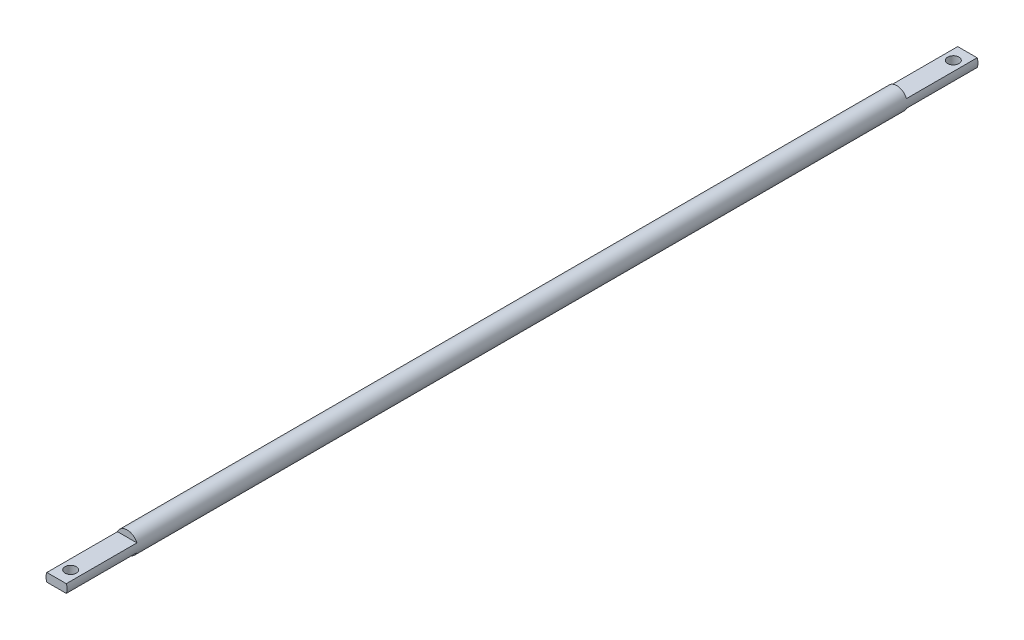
ISO-10303-21;
HEADER;
FILE_DESCRIPTION(('STEP AP214'),'2;1');
FILE_NAME('part.step','',(''),(''),'','','');
FILE_SCHEMA(('AUTOMOTIVE_DESIGN { 1 0 10303 214 1 1 1 1 }'));
ENDSEC;
DATA;
#1=APPLICATION_CONTEXT('core data for automotive mechanical design processes');
#2=APPLICATION_PROTOCOL_DEFINITION('international standard','automotive_design',2000,#1);
#3=PRODUCT_CONTEXT('',#1,'mechanical');
#4=PRODUCT('Part','Part','',(#3));
#5=PRODUCT_RELATED_PRODUCT_CATEGORY('part','',(#4));
#6=PRODUCT_DEFINITION_FORMATION('','',#4);
#7=PRODUCT_DEFINITION_CONTEXT('part definition',#1,'design');
#8=PRODUCT_DEFINITION('design','',#6,#7);
#9=PRODUCT_DEFINITION_SHAPE('','',#8);
#10=(LENGTH_UNIT() NAMED_UNIT(*) SI_UNIT(.MILLI.,.METRE.));
#11=(NAMED_UNIT(*) PLANE_ANGLE_UNIT() SI_UNIT($,.RADIAN.));
#12=(NAMED_UNIT(*) SI_UNIT($,.STERADIAN.) SOLID_ANGLE_UNIT());
#13=UNCERTAINTY_MEASURE_WITH_UNIT(LENGTH_MEASURE(1.E-05),#10,'distance_accuracy_value','');
#14=(GEOMETRIC_REPRESENTATION_CONTEXT(3) GLOBAL_UNCERTAINTY_ASSIGNED_CONTEXT((#13)) GLOBAL_UNIT_ASSIGNED_CONTEXT((#10,
#11,#12)) REPRESENTATION_CONTEXT('',''));
#15=CARTESIAN_POINT('',(0.,0.,0.));
#16=DIRECTION('',(0.,0.,1.));
#17=DIRECTION('',(1.,0.,0.));
#18=AXIS2_PLACEMENT_3D('',#15,#16,#17);
#19=CARTESIAN_POINT('',(8.29864188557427,3.,-272.5));
#20=DIRECTION('',(0.,-1.,0.));
#21=DIRECTION('',(0.,0.,-1.));
#22=AXIS2_PLACEMENT_3D('',#19,#20,#21);
#23=PLANE('',#22);
#24=DIRECTION('',(-1.,0.,0.));
#25=VECTOR('',#24,1.);
#26=CARTESIAN_POINT('',(8.29864188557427,3.,-272.5));
#27=LINE('',#26,#25);
#28=CARTESIAN_POINT('',(6.87386354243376,3.,-272.5));
#29=VERTEX_POINT('',#28);
#30=CARTESIAN_POINT('',(-6.87386354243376,3.,-272.5));
#31=VERTEX_POINT('',#30);
#32=EDGE_CURVE('E109',#29,#31,#27,.T.);
#33=ORIENTED_EDGE('',*,*,#32,.F.);
#34=DIRECTION('',(0.,0.,-1.));
#35=VECTOR('',#34,1.);
#36=CARTESIAN_POINT('',(6.87386354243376,3.,322.5));
#37=LINE('',#36,#35);
#38=CARTESIAN_POINT('',(6.87386354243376,3.,-322.5));
#39=VERTEX_POINT('',#38);
#40=EDGE_CURVE('E142',#39,#29,#37,.F.);
#41=ORIENTED_EDGE('',*,*,#40,.F.);
#42=DIRECTION('',(1.,0.,0.));
#43=VECTOR('',#42,1.);
#44=CARTESIAN_POINT('',(0.,3.,-322.5));
#45=LINE('',#44,#43);
#46=CARTESIAN_POINT('',(-6.87386354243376,3.,-322.5));
#47=VERTEX_POINT('',#46);
#48=EDGE_CURVE('E113',#47,#39,#45,.T.);
#49=ORIENTED_EDGE('',*,*,#48,.F.);
#50=DIRECTION('',(0.,0.,-1.));
#51=VECTOR('',#50,1.);
#52=CARTESIAN_POINT('',(-6.87386354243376,3.,322.5));
#53=LINE('',#52,#51);
#54=EDGE_CURVE('E143',#31,#47,#53,.T.);
#55=ORIENTED_EDGE('',*,*,#54,.F.);
#56=EDGE_LOOP('',(#33,#41,#49,#55));
#57=FACE_BOUND('',#56,.T.);
#58=CARTESIAN_POINT('',(0.,3.,-312.5));
#59=DIRECTION('',(0.,-1.,0.));
#60=DIRECTION('',(0.,0.,-1.));
#61=AXIS2_PLACEMENT_3D('',#58,#59,#60);
#62=CIRCLE('',#61,4.);
#63=CARTESIAN_POINT('',(0.,3.,-316.5));
#64=VERTEX_POINT('',#63);
#65=EDGE_CURVE('E304',#64,#64,#62,.F.);
#66=ORIENTED_EDGE('',*,*,#65,.F.);
#67=EDGE_LOOP('',(#66));
#68=FACE_BOUND('',#67,.T.);
#69=ADVANCED_FACE('F36',(#57,#68),#23,.F.);
#70=CARTESIAN_POINT('',(8.29864188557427,-3.,-272.5));
#71=DIRECTION('',(0.,1.,0.));
#72=DIRECTION('',(0.,0.,1.));
#73=AXIS2_PLACEMENT_3D('',#70,#71,#72);
#74=PLANE('',#73);
#75=DIRECTION('',(1.,0.,0.));
#76=VECTOR('',#75,1.);
#77=CARTESIAN_POINT('',(8.29864188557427,-3.,-272.5));
#78=LINE('',#77,#76);
#79=CARTESIAN_POINT('',(-6.87386354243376,-3.,-272.5));
#80=VERTEX_POINT('',#79);
#81=CARTESIAN_POINT('',(6.87386354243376,-3.,-272.5));
#82=VERTEX_POINT('',#81);
#83=EDGE_CURVE('E296',#80,#82,#78,.T.);
#84=ORIENTED_EDGE('',*,*,#83,.F.);
#85=DIRECTION('',(0.,0.,-1.));
#86=VECTOR('',#85,1.);
#87=CARTESIAN_POINT('',(-6.87386354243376,-3.,322.5));
#88=LINE('',#87,#86);
#89=CARTESIAN_POINT('',(-6.87386354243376,-3.,-322.5));
#90=VERTEX_POINT('',#89);
#91=EDGE_CURVE('E51',#90,#80,#88,.F.);
#92=ORIENTED_EDGE('',*,*,#91,.F.);
#93=DIRECTION('',(-1.,0.,0.));
#94=VECTOR('',#93,1.);
#95=CARTESIAN_POINT('',(0.,-3.,-322.5));
#96=LINE('',#95,#94);
#97=CARTESIAN_POINT('',(6.87386354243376,-3.,-322.5));
#98=VERTEX_POINT('',#97);
#99=EDGE_CURVE('E44',#98,#90,#96,.T.);
#100=ORIENTED_EDGE('',*,*,#99,.F.);
#101=DIRECTION('',(0.,0.,-1.));
#102=VECTOR('',#101,1.);
#103=CARTESIAN_POINT('',(6.87386354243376,-3.,322.5));
#104=LINE('',#103,#102);
#105=EDGE_CURVE('E102',#82,#98,#104,.T.);
#106=ORIENTED_EDGE('',*,*,#105,.F.);
#107=EDGE_LOOP('',(#84,#92,#100,#106));
#108=FACE_BOUND('',#107,.T.);
#109=CARTESIAN_POINT('',(0.,-3.,-312.5));
#110=DIRECTION('',(0.,1.,0.));
#111=DIRECTION('',(0.,0.,1.));
#112=AXIS2_PLACEMENT_3D('',#109,#110,#111);
#113=CIRCLE('',#112,4.);
#114=CARTESIAN_POINT('',(0.,-3.,-308.5));
#115=VERTEX_POINT('',#114);
#116=EDGE_CURVE('E307',#115,#115,#113,.T.);
#117=ORIENTED_EDGE('',*,*,#116,.T.);
#118=EDGE_LOOP('',(#117));
#119=FACE_BOUND('',#118,.T.);
#120=ADVANCED_FACE('F100',(#108,#119),#74,.F.);
#121=CARTESIAN_POINT('',(0.,0.,322.5));
#122=DIRECTION('',(0.,0.,-1.));
#123=DIRECTION('',(-1.,0.,0.));
#124=AXIS2_PLACEMENT_3D('',#121,#122,#123);
#125=CYLINDRICAL_SURFACE('',#124,7.5);
#126=CARTESIAN_POINT('',(0.,0.,322.5));
#127=DIRECTION('',(0.,0.,1.));
#128=DIRECTION('',(1.,0.,0.));
#129=AXIS2_PLACEMENT_3D('',#126,#127,#128);
#130=CIRCLE('',#129,7.5);
#131=CARTESIAN_POINT('',(6.87386354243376,-3.,322.5));
#132=VERTEX_POINT('',#131);
#133=CARTESIAN_POINT('',(6.87386354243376,3.,322.5));
#134=VERTEX_POINT('',#133);
#135=EDGE_CURVE('E117',#132,#134,#130,.T.);
#136=ORIENTED_EDGE('',*,*,#135,.F.);
#137=DIRECTION('',(0.,0.,-1.));
#138=VECTOR('',#137,1.);
#139=CARTESIAN_POINT('',(6.87386354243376,-3.,322.5));
#140=LINE('',#139,#138);
#141=CARTESIAN_POINT('',(6.87386354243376,-3.,272.5));
#142=VERTEX_POINT('',#141);
#143=EDGE_CURVE('E154',#132,#142,#140,.T.);
#144=ORIENTED_EDGE('',*,*,#143,.T.);
#145=CARTESIAN_POINT('',(0.,0.,272.5));
#146=DIRECTION('',(0.,0.,1.));
#147=DIRECTION('',(1.,0.,0.));
#148=AXIS2_PLACEMENT_3D('',#145,#146,#147);
#149=CIRCLE('',#148,7.5);
#150=CARTESIAN_POINT('',(-6.87386354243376,-3.,272.5));
#151=VERTEX_POINT('',#150);
#152=EDGE_CURVE('E131',#151,#142,#149,.T.);
#153=ORIENTED_EDGE('',*,*,#152,.F.);
#154=DIRECTION('',(0.,0.,-1.));
#155=VECTOR('',#154,1.);
#156=CARTESIAN_POINT('',(-6.87386354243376,-3.,322.5));
#157=LINE('',#156,#155);
#158=CARTESIAN_POINT('',(-6.87386354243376,-3.,322.5));
#159=VERTEX_POINT('',#158);
#160=EDGE_CURVE('E151',#151,#159,#157,.F.);
#161=ORIENTED_EDGE('',*,*,#160,.T.);
#162=CARTESIAN_POINT('',(-6.87386354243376,3.,322.5));
#163=VERTEX_POINT('',#162);
#164=EDGE_CURVE('E123',#163,#159,#130,.T.);
#165=ORIENTED_EDGE('',*,*,#164,.F.);
#166=DIRECTION('',(0.,0.,-1.));
#167=VECTOR('',#166,1.);
#168=CARTESIAN_POINT('',(-6.87386354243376,3.,322.5));
#169=LINE('',#168,#167);
#170=CARTESIAN_POINT('',(-6.87386354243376,3.,272.5));
#171=VERTEX_POINT('',#170);
#172=EDGE_CURVE('E115',#163,#171,#169,.T.);
#173=ORIENTED_EDGE('',*,*,#172,.T.);
#174=CARTESIAN_POINT('',(0.,0.,272.5));
#175=DIRECTION('',(0.,0.,1.));
#176=DIRECTION('',(1.,0.,0.));
#177=AXIS2_PLACEMENT_3D('',#174,#175,#176);
#178=CIRCLE('',#177,7.5);
#179=CARTESIAN_POINT('',(6.87386354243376,3.,272.5));
#180=VERTEX_POINT('',#179);
#181=EDGE_CURVE('E127',#180,#171,#178,.T.);
#182=ORIENTED_EDGE('',*,*,#181,.F.);
#183=DIRECTION('',(0.,0.,-1.));
#184=VECTOR('',#183,1.);
#185=CARTESIAN_POINT('',(6.87386354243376,3.,322.5));
#186=LINE('',#185,#184);
#187=EDGE_CURVE('E119',#180,#134,#186,.F.);
#188=ORIENTED_EDGE('',*,*,#187,.T.);
#189=EDGE_LOOP('',(#136,#144,#153,#161,#165,#173,#182,#188));
#190=FACE_BOUND('',#189,.T.);
#191=CARTESIAN_POINT('',(0.,0.,-272.5));
#192=DIRECTION('',(0.,0.,-1.));
#193=DIRECTION('',(-1.,0.,0.));
#194=AXIS2_PLACEMENT_3D('',#191,#192,#193);
#195=CIRCLE('',#194,7.5);
#196=EDGE_CURVE('E11',#82,#80,#195,.T.);
#197=ORIENTED_EDGE('',*,*,#196,.F.);
#198=ORIENTED_EDGE('',*,*,#105,.T.);
#199=CARTESIAN_POINT('',(0.,0.,-322.5));
#200=DIRECTION('',(0.,0.,1.));
#201=DIRECTION('',(1.,0.,0.));
#202=AXIS2_PLACEMENT_3D('',#199,#200,#201);
#203=CIRCLE('',#202,7.5);
#204=EDGE_CURVE('E59',#98,#39,#203,.T.);
#205=ORIENTED_EDGE('',*,*,#204,.T.);
#206=ORIENTED_EDGE('',*,*,#40,.T.);
#207=CARTESIAN_POINT('',(0.,0.,-272.5));
#208=DIRECTION('',(0.,0.,-1.));
#209=DIRECTION('',(-1.,0.,0.));
#210=AXIS2_PLACEMENT_3D('',#207,#208,#209);
#211=CIRCLE('',#210,7.5);
#212=EDGE_CURVE('E107',#31,#29,#211,.T.);
#213=ORIENTED_EDGE('',*,*,#212,.F.);
#214=ORIENTED_EDGE('',*,*,#54,.T.);
#215=EDGE_CURVE('E114',#47,#90,#203,.T.);
#216=ORIENTED_EDGE('',*,*,#215,.T.);
#217=ORIENTED_EDGE('',*,*,#91,.T.);
#218=EDGE_LOOP('',(#197,#198,#205,#206,#213,#214,#216,#217));
#219=FACE_BOUND('',#218,.T.);
#220=ADVANCED_FACE('F38',(#190,#219),#125,.T.);
#221=CARTESIAN_POINT('',(0.,0.,322.5));
#222=DIRECTION('',(0.,0.,1.));
#223=DIRECTION('',(1.,0.,0.));
#224=AXIS2_PLACEMENT_3D('',#221,#222,#223);
#225=PLANE('',#224);
#226=DIRECTION('',(-1.,0.,0.));
#227=VECTOR('',#226,1.);
#228=CARTESIAN_POINT('',(0.,-3.,322.5));
#229=LINE('',#228,#227);
#230=EDGE_CURVE('E129',#132,#159,#229,.T.);
#231=ORIENTED_EDGE('',*,*,#230,.F.);
#232=ORIENTED_EDGE('',*,*,#135,.T.);
#233=DIRECTION('',(1.,0.,0.));
#234=VECTOR('',#233,1.);
#235=CARTESIAN_POINT('',(0.,3.,322.5));
#236=LINE('',#235,#234);
#237=EDGE_CURVE('E124',#163,#134,#236,.T.);
#238=ORIENTED_EDGE('',*,*,#237,.F.);
#239=ORIENTED_EDGE('',*,*,#164,.T.);
#240=EDGE_LOOP('',(#231,#232,#238,#239));
#241=FACE_BOUND('',#240,.T.);
#242=ADVANCED_FACE('F179',(#241),#225,.T.);
#243=CARTESIAN_POINT('',(0.,0.,-322.5));
#244=DIRECTION('',(0.,0.,1.));
#245=DIRECTION('',(1.,0.,0.));
#246=AXIS2_PLACEMENT_3D('',#243,#244,#245);
#247=PLANE('',#246);
#248=ORIENTED_EDGE('',*,*,#204,.F.);
#249=ORIENTED_EDGE('',*,*,#99,.T.);
#250=ORIENTED_EDGE('',*,*,#215,.F.);
#251=ORIENTED_EDGE('',*,*,#48,.T.);
#252=EDGE_LOOP('',(#248,#249,#250,#251));
#253=FACE_BOUND('',#252,.T.);
#254=ADVANCED_FACE('F112',(#253),#247,.F.);
#255=CARTESIAN_POINT('',(-8.41387697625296,3.,272.5));
#256=DIRECTION('',(0.,0.,1.));
#257=DIRECTION('',(1.,0.,0.));
#258=AXIS2_PLACEMENT_3D('',#255,#256,#257);
#259=PLANE('',#258);
#260=ORIENTED_EDGE('',*,*,#181,.T.);
#261=DIRECTION('',(1.,0.,0.));
#262=VECTOR('',#261,1.);
#263=CARTESIAN_POINT('',(-8.41387697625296,3.,272.5));
#264=LINE('',#263,#262);
#265=EDGE_CURVE('E157',#171,#180,#264,.T.);
#266=ORIENTED_EDGE('',*,*,#265,.T.);
#267=EDGE_LOOP('',(#260,#266));
#268=FACE_BOUND('',#267,.T.);
#269=ADVANCED_FACE('F169',(#268),#259,.T.);
#270=CARTESIAN_POINT('',(-8.41387697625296,3.,272.5));
#271=DIRECTION('',(0.,-1.,0.));
#272=DIRECTION('',(0.,0.,-1.));
#273=AXIS2_PLACEMENT_3D('',#270,#271,#272);
#274=PLANE('',#273);
#275=CARTESIAN_POINT('',(0.,3.,312.5));
#276=DIRECTION('',(0.,-1.,0.));
#277=DIRECTION('',(0.,0.,-1.));
#278=AXIS2_PLACEMENT_3D('',#275,#276,#277);
#279=CIRCLE('',#278,4.00000000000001);
#280=CARTESIAN_POINT('',(0.,3.,308.5));
#281=VERTEX_POINT('',#280);
#282=EDGE_CURVE('E297',#281,#281,#279,.T.);
#283=ORIENTED_EDGE('',*,*,#282,.T.);
#284=EDGE_LOOP('',(#283));
#285=FACE_BOUND('',#284,.T.);
#286=ORIENTED_EDGE('',*,*,#237,.T.);
#287=ORIENTED_EDGE('',*,*,#187,.F.);
#288=ORIENTED_EDGE('',*,*,#265,.F.);
#289=ORIENTED_EDGE('',*,*,#172,.F.);
#290=EDGE_LOOP('',(#286,#287,#288,#289));
#291=FACE_BOUND('',#290,.T.);
#292=ADVANCED_FACE('F166',(#285,#291),#274,.F.);
#293=CARTESIAN_POINT('',(7.85060487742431,-7.71740382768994,272.5));
#294=DIRECTION('',(0.,0.,1.));
#295=DIRECTION('',(1.,0.,0.));
#296=AXIS2_PLACEMENT_3D('',#293,#294,#295);
#297=PLANE('',#296);
#298=ORIENTED_EDGE('',*,*,#152,.T.);
#299=DIRECTION('',(-1.,0.,0.));
#300=VECTOR('',#299,1.);
#301=CARTESIAN_POINT('',(-8.41387697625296,-3.,272.5));
#302=LINE('',#301,#300);
#303=EDGE_CURVE('E146',#142,#151,#302,.T.);
#304=ORIENTED_EDGE('',*,*,#303,.T.);
#305=EDGE_LOOP('',(#298,#304));
#306=FACE_BOUND('',#305,.T.);
#307=ADVANCED_FACE('F176',(#306),#297,.T.);
#308=CARTESIAN_POINT('',(-8.41387697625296,-3.,272.5));
#309=DIRECTION('',(0.,1.,0.));
#310=DIRECTION('',(0.,0.,1.));
#311=AXIS2_PLACEMENT_3D('',#308,#309,#310);
#312=PLANE('',#311);
#313=CARTESIAN_POINT('',(0.,-3.,312.5));
#314=DIRECTION('',(0.,-1.,0.));
#315=DIRECTION('',(0.,0.,-1.));
#316=AXIS2_PLACEMENT_3D('',#313,#314,#315);
#317=CIRCLE('',#316,4.00000000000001);
#318=CARTESIAN_POINT('',(0.,-3.,308.5));
#319=VERTEX_POINT('',#318);
#320=EDGE_CURVE('E201',#319,#319,#317,.T.);
#321=ORIENTED_EDGE('',*,*,#320,.F.);
#322=EDGE_LOOP('',(#321));
#323=FACE_BOUND('',#322,.T.);
#324=ORIENTED_EDGE('',*,*,#230,.T.);
#325=ORIENTED_EDGE('',*,*,#160,.F.);
#326=ORIENTED_EDGE('',*,*,#303,.F.);
#327=ORIENTED_EDGE('',*,*,#143,.F.);
#328=EDGE_LOOP('',(#324,#325,#326,#327));
#329=FACE_BOUND('',#328,.T.);
#330=ADVANCED_FACE('F190',(#323,#329),#312,.F.);
#331=CARTESIAN_POINT('',(8.29864188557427,3.,-272.5));
#332=DIRECTION('',(0.,0.,-1.));
#333=DIRECTION('',(-1.,0.,0.));
#334=AXIS2_PLACEMENT_3D('',#331,#332,#333);
#335=PLANE('',#334);
#336=ORIENTED_EDGE('',*,*,#212,.T.);
#337=ORIENTED_EDGE('',*,*,#32,.T.);
#338=EDGE_LOOP('',(#336,#337));
#339=FACE_BOUND('',#338,.T.);
#340=ADVANCED_FACE('F138',(#339),#335,.T.);
#341=CARTESIAN_POINT('',(8.29864188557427,-3.,-272.5));
#342=DIRECTION('',(0.,0.,-1.));
#343=DIRECTION('',(-1.,0.,0.));
#344=AXIS2_PLACEMENT_3D('',#341,#342,#343);
#345=PLANE('',#344);
#346=ORIENTED_EDGE('',*,*,#196,.T.);
#347=ORIENTED_EDGE('',*,*,#83,.T.);
#348=EDGE_LOOP('',(#346,#347));
#349=FACE_BOUND('',#348,.T.);
#350=ADVANCED_FACE('F197',(#349),#345,.T.);
#351=CARTESIAN_POINT('',(0.,7.5,312.5));
#352=DIRECTION('',(0.,-1.,0.));
#353=DIRECTION('',(0.,0.,-1.));
#354=AXIS2_PLACEMENT_3D('',#351,#352,#353);
#355=CYLINDRICAL_SURFACE('',#354,4.00000000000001);
#356=ORIENTED_EDGE('',*,*,#320,.T.);
#357=EDGE_LOOP('',(#356));
#358=FACE_BOUND('',#357,.T.);
#359=ORIENTED_EDGE('',*,*,#282,.F.);
#360=EDGE_LOOP('',(#359));
#361=FACE_BOUND('',#360,.T.);
#362=ADVANCED_FACE('F235',(#358,#361),#355,.F.);
#363=CARTESIAN_POINT('',(0.,7.5,-312.5));
#364=DIRECTION('',(0.,-1.,0.));
#365=DIRECTION('',(0.,0.,-1.));
#366=AXIS2_PLACEMENT_3D('',#363,#364,#365);
#367=CYLINDRICAL_SURFACE('',#366,4.);
#368=ORIENTED_EDGE('',*,*,#116,.F.);
#369=EDGE_LOOP('',(#368));
#370=FACE_BOUND('',#369,.T.);
#371=ORIENTED_EDGE('',*,*,#65,.T.);
#372=EDGE_LOOP('',(#371));
#373=FACE_BOUND('',#372,.T.);
#374=ADVANCED_FACE('F231',(#370,#373),#367,.F.);
#375=CLOSED_SHELL('',(#69,#120,#220,#242,#254,#269,#292,#307,#330,#340,#350,#362,#374));
#376=MANIFOLD_SOLID_BREP('B2',#375);
#377=ADVANCED_BREP_SHAPE_REPRESENTATION('',(#18,#376),#14);
#378=SHAPE_DEFINITION_REPRESENTATION(#9,#377);
ENDSEC;
END-ISO-10303-21;
